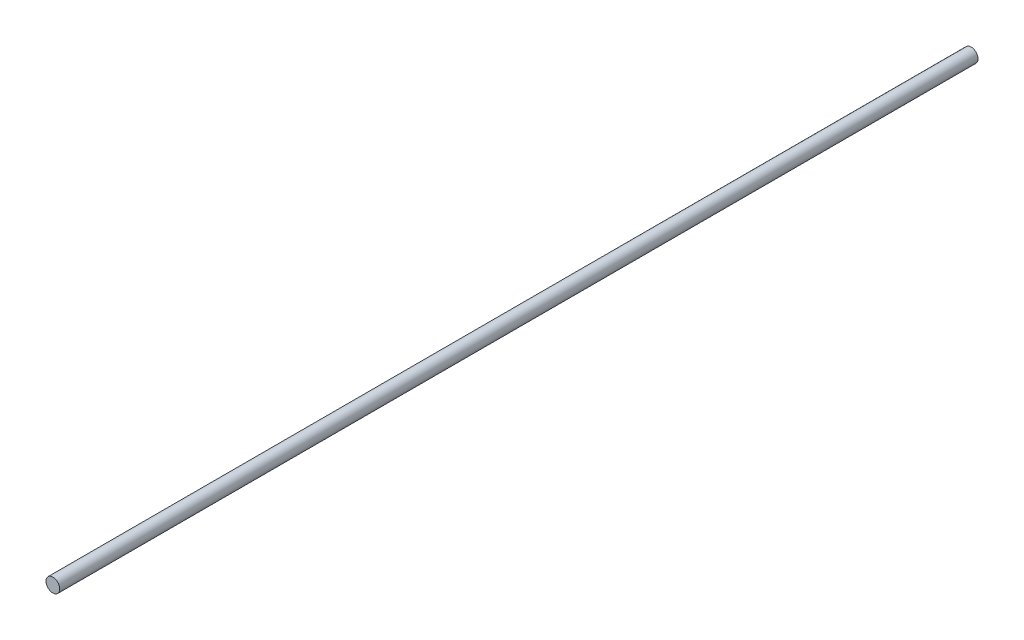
ISO-10303-21;
HEADER;
FILE_DESCRIPTION(('STEP AP214'),'2;1');
FILE_NAME('part.step','',(''),(''),'','','');
FILE_SCHEMA(('AUTOMOTIVE_DESIGN { 1 0 10303 214 1 1 1 1 }'));
ENDSEC;
DATA;
#1=APPLICATION_CONTEXT('core data for automotive mechanical design processes');
#2=APPLICATION_PROTOCOL_DEFINITION('international standard','automotive_design',2000,#1);
#3=PRODUCT_CONTEXT('',#1,'mechanical');
#4=PRODUCT('Part','Part','',(#3));
#5=PRODUCT_RELATED_PRODUCT_CATEGORY('part','',(#4));
#6=PRODUCT_DEFINITION_FORMATION('','',#4);
#7=PRODUCT_DEFINITION_CONTEXT('part definition',#1,'design');
#8=PRODUCT_DEFINITION('design','',#6,#7);
#9=PRODUCT_DEFINITION_SHAPE('','',#8);
#10=(LENGTH_UNIT() NAMED_UNIT(*) SI_UNIT(.MILLI.,.METRE.));
#11=(NAMED_UNIT(*) PLANE_ANGLE_UNIT() SI_UNIT($,.RADIAN.));
#12=(NAMED_UNIT(*) SI_UNIT($,.STERADIAN.) SOLID_ANGLE_UNIT());
#13=UNCERTAINTY_MEASURE_WITH_UNIT(LENGTH_MEASURE(1.E-05),#10,'distance_accuracy_value','');
#14=(GEOMETRIC_REPRESENTATION_CONTEXT(3) GLOBAL_UNCERTAINTY_ASSIGNED_CONTEXT((#13)) GLOBAL_UNIT_ASSIGNED_CONTEXT((#10,
#11,#12)) REPRESENTATION_CONTEXT('',''));
#15=CARTESIAN_POINT('',(0.,0.,0.));
#16=DIRECTION('',(0.,0.,1.));
#17=DIRECTION('',(1.,0.,0.));
#18=AXIS2_PLACEMENT_3D('',#15,#16,#17);
#19=CARTESIAN_POINT('',(0.,0.,-4000.));
#20=DIRECTION('',(0.,0.,1.));
#21=DIRECTION('',(1.,0.,0.));
#22=AXIS2_PLACEMENT_3D('',#19,#20,#21);
#23=CYLINDRICAL_SURFACE('',#22,30.);
#24=CARTESIAN_POINT('',(0.,0.,-4000.));
#25=DIRECTION('',(0.,0.,1.));
#26=DIRECTION('',(1.,0.,0.));
#27=AXIS2_PLACEMENT_3D('',#24,#25,#26);
#28=CIRCLE('',#27,30.);
#29=CARTESIAN_POINT('',(30.,0.,-4000.));
#30=VERTEX_POINT('',#29);
#31=EDGE_CURVE('E10',#30,#30,#28,.T.);
#32=ORIENTED_EDGE('',*,*,#31,.T.);
#33=EDGE_LOOP('',(#32));
#34=FACE_BOUND('',#33,.T.);
#35=CARTESIAN_POINT('',(0.,0.,0.));
#36=DIRECTION('',(0.,0.,1.));
#37=DIRECTION('',(1.,0.,0.));
#38=AXIS2_PLACEMENT_3D('',#35,#36,#37);
#39=CIRCLE('',#38,30.);
#40=CARTESIAN_POINT('',(30.,0.,0.));
#41=VERTEX_POINT('',#40);
#42=EDGE_CURVE('E40',#41,#41,#39,.T.);
#43=ORIENTED_EDGE('',*,*,#42,.F.);
#44=EDGE_LOOP('',(#43));
#45=FACE_BOUND('',#44,.T.);
#46=ADVANCED_FACE('F37',(#34,#45),#23,.T.);
#47=CARTESIAN_POINT('',(0.,0.,-4000.));
#48=DIRECTION('',(0.,0.,1.));
#49=DIRECTION('',(1.,0.,0.));
#50=AXIS2_PLACEMENT_3D('',#47,#48,#49);
#51=PLANE('',#50);
#52=ORIENTED_EDGE('',*,*,#31,.F.);
#53=EDGE_LOOP('',(#52));
#54=FACE_BOUND('',#53,.T.);
#55=ADVANCED_FACE('F54',(#54),#51,.F.);
#56=CARTESIAN_POINT('',(0.,0.,0.));
#57=DIRECTION('',(0.,0.,1.));
#58=DIRECTION('',(1.,0.,0.));
#59=AXIS2_PLACEMENT_3D('',#56,#57,#58);
#60=PLANE('',#59);
#61=ORIENTED_EDGE('',*,*,#42,.T.);
#62=EDGE_LOOP('',(#61));
#63=FACE_BOUND('',#62,.T.);
#64=ADVANCED_FACE('F51',(#63),#60,.T.);
#65=CLOSED_SHELL('',(#46,#55,#64));
#66=MANIFOLD_SOLID_BREP('B2',#65);
#67=ADVANCED_BREP_SHAPE_REPRESENTATION('',(#18,#66),#14);
#68=SHAPE_DEFINITION_REPRESENTATION(#9,#67);
ENDSEC;
END-ISO-10303-21;
